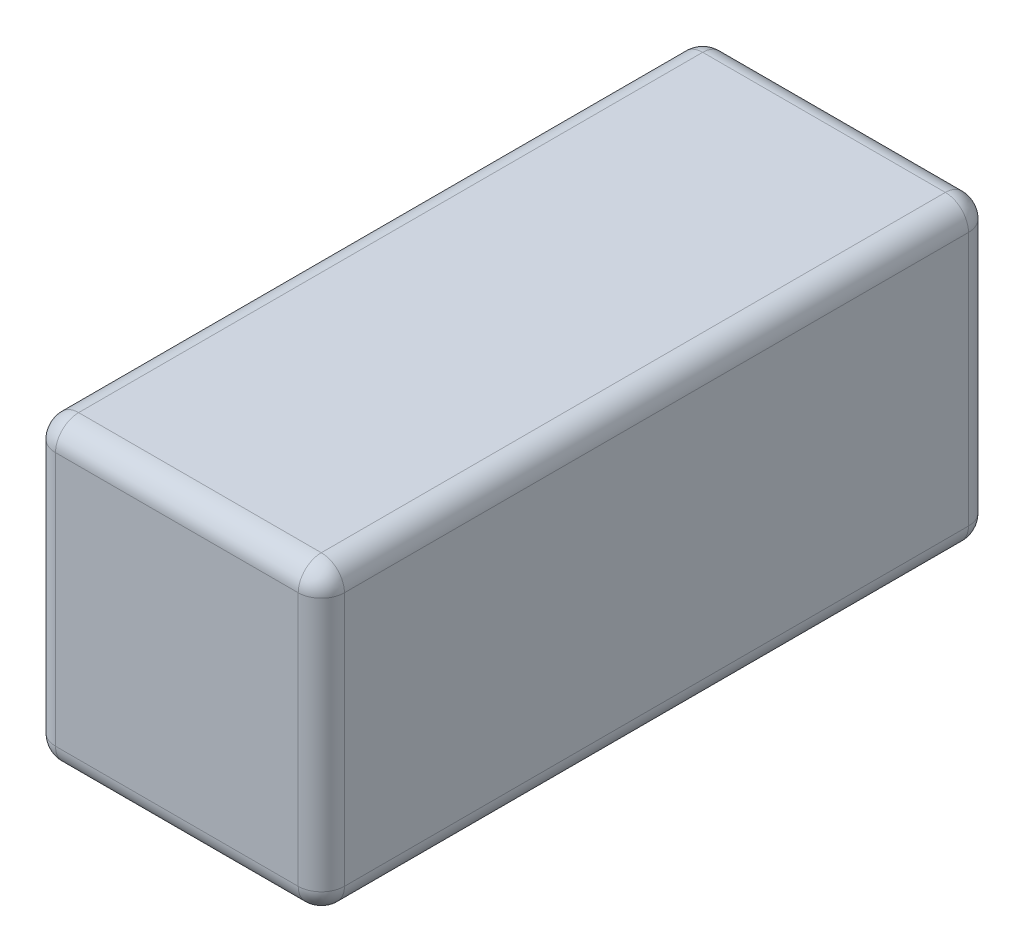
ISO-10303-21;
HEADER;
FILE_DESCRIPTION(('STEP AP214'),'2;1');
FILE_NAME('part.step','',(''),(''),'','','');
FILE_SCHEMA(('AUTOMOTIVE_DESIGN { 1 0 10303 214 1 1 1 1 }'));
ENDSEC;
DATA;
#1=APPLICATION_CONTEXT('core data for automotive mechanical design processes');
#2=APPLICATION_PROTOCOL_DEFINITION('international standard','automotive_design',2000,#1);
#3=PRODUCT_CONTEXT('',#1,'mechanical');
#4=PRODUCT('Part','Part','',(#3));
#5=PRODUCT_RELATED_PRODUCT_CATEGORY('part','',(#4));
#6=PRODUCT_DEFINITION_FORMATION('','',#4);
#7=PRODUCT_DEFINITION_CONTEXT('part definition',#1,'design');
#8=PRODUCT_DEFINITION('design','',#6,#7);
#9=PRODUCT_DEFINITION_SHAPE('','',#8);
#10=(LENGTH_UNIT() NAMED_UNIT(*) SI_UNIT(.MILLI.,.METRE.));
#11=(NAMED_UNIT(*) PLANE_ANGLE_UNIT() SI_UNIT($,.RADIAN.));
#12=(NAMED_UNIT(*) SI_UNIT($,.STERADIAN.) SOLID_ANGLE_UNIT());
#13=UNCERTAINTY_MEASURE_WITH_UNIT(LENGTH_MEASURE(1.E-05),#10,'distance_accuracy_value','');
#14=(GEOMETRIC_REPRESENTATION_CONTEXT(3) GLOBAL_UNCERTAINTY_ASSIGNED_CONTEXT((#13)) GLOBAL_UNIT_ASSIGNED_CONTEXT((#10,
#11,#12)) REPRESENTATION_CONTEXT('',''));
#15=CARTESIAN_POINT('',(0.,0.,0.));
#16=DIRECTION('',(0.,0.,1.));
#17=DIRECTION('',(1.,0.,0.));
#18=AXIS2_PLACEMENT_3D('',#15,#16,#17);
#19=CARTESIAN_POINT('',(-12.5,13.,29.));
#20=DIRECTION('',(1.,0.,0.));
#21=DIRECTION('',(0.,0.,-1.));
#22=AXIS2_PLACEMENT_3D('',#19,#20,#21);
#23=PLANE('',#22);
#24=DIRECTION('',(0.,0.,-1.));
#25=VECTOR('',#24,1.);
#26=CARTESIAN_POINT('',(-12.5,-11.,29.));
#27=LINE('',#26,#25);
#28=CARTESIAN_POINT('',(-12.5,-11.,-27.));
#29=VERTEX_POINT('',#28);
#30=CARTESIAN_POINT('',(-12.5,-11.,27.));
#31=VERTEX_POINT('',#30);
#32=EDGE_CURVE('E237',#29,#31,#27,.F.);
#33=ORIENTED_EDGE('',*,*,#32,.T.);
#34=DIRECTION('',(0.,-1.,0.));
#35=VECTOR('',#34,1.);
#36=CARTESIAN_POINT('',(-12.5,13.,27.));
#37=LINE('',#36,#35);
#38=CARTESIAN_POINT('',(-12.5,11.,27.));
#39=VERTEX_POINT('',#38);
#40=EDGE_CURVE('E239',#31,#39,#37,.F.);
#41=ORIENTED_EDGE('',*,*,#40,.T.);
#42=DIRECTION('',(0.,0.,-1.));
#43=VECTOR('',#42,1.);
#44=CARTESIAN_POINT('',(-12.5,11.,29.));
#45=LINE('',#44,#43);
#46=CARTESIAN_POINT('',(-12.5,11.,-27.));
#47=VERTEX_POINT('',#46);
#48=EDGE_CURVE('E228',#39,#47,#45,.T.);
#49=ORIENTED_EDGE('',*,*,#48,.T.);
#50=DIRECTION('',(0.,-1.,0.));
#51=VECTOR('',#50,1.);
#52=CARTESIAN_POINT('',(-12.5,13.,-27.));
#53=LINE('',#52,#51);
#54=EDGE_CURVE('E235',#47,#29,#53,.T.);
#55=ORIENTED_EDGE('',*,*,#54,.T.);
#56=EDGE_LOOP('',(#33,#41,#49,#55));
#57=FACE_BOUND('',#56,.T.);
#58=ADVANCED_FACE('F39',(#57),#23,.F.);
#59=CARTESIAN_POINT('',(-12.5,-13.,29.));
#60=DIRECTION('',(0.,1.,0.));
#61=DIRECTION('',(0.,0.,1.));
#62=AXIS2_PLACEMENT_3D('',#59,#60,#61);
#63=PLANE('',#62);
#64=DIRECTION('',(1.,0.,0.));
#65=VECTOR('',#64,1.);
#66=CARTESIAN_POINT('',(-12.5,-13.,-27.));
#67=LINE('',#66,#65);
#68=CARTESIAN_POINT('',(-10.5,-13.,-27.));
#69=VERTEX_POINT('',#68);
#70=CARTESIAN_POINT('',(10.5,-13.,-27.));
#71=VERTEX_POINT('',#70);
#72=EDGE_CURVE('E272',#69,#71,#67,.T.);
#73=ORIENTED_EDGE('',*,*,#72,.T.);
#74=DIRECTION('',(0.,0.,-1.));
#75=VECTOR('',#74,1.);
#76=CARTESIAN_POINT('',(10.5,-13.,29.));
#77=LINE('',#76,#75);
#78=CARTESIAN_POINT('',(10.5,-13.,27.));
#79=VERTEX_POINT('',#78);
#80=EDGE_CURVE('E290',#71,#79,#77,.F.);
#81=ORIENTED_EDGE('',*,*,#80,.T.);
#82=DIRECTION('',(1.,0.,0.));
#83=VECTOR('',#82,1.);
#84=CARTESIAN_POINT('',(-12.5,-13.,27.));
#85=LINE('',#84,#83);
#86=CARTESIAN_POINT('',(-10.5,-13.,27.));
#87=VERTEX_POINT('',#86);
#88=EDGE_CURVE('E220',#79,#87,#85,.F.);
#89=ORIENTED_EDGE('',*,*,#88,.T.);
#90=DIRECTION('',(0.,0.,-1.));
#91=VECTOR('',#90,1.);
#92=CARTESIAN_POINT('',(-10.5,-13.,29.));
#93=LINE('',#92,#91);
#94=EDGE_CURVE('E287',#87,#69,#93,.T.);
#95=ORIENTED_EDGE('',*,*,#94,.T.);
#96=EDGE_LOOP('',(#73,#81,#89,#95));
#97=FACE_BOUND('',#96,.T.);
#98=ADVANCED_FACE('F307',(#97),#63,.F.);
#99=CARTESIAN_POINT('',(12.5,13.,29.));
#100=DIRECTION('',(-1.,0.,0.));
#101=DIRECTION('',(0.,0.,1.));
#102=AXIS2_PLACEMENT_3D('',#99,#100,#101);
#103=PLANE('',#102);
#104=DIRECTION('',(0.,0.,-1.));
#105=VECTOR('',#104,1.);
#106=CARTESIAN_POINT('',(12.5,11.,29.));
#107=LINE('',#106,#105);
#108=CARTESIAN_POINT('',(12.5,11.,-27.));
#109=VERTEX_POINT('',#108);
#110=CARTESIAN_POINT('',(12.5,11.,27.));
#111=VERTEX_POINT('',#110);
#112=EDGE_CURVE('E273',#109,#111,#107,.F.);
#113=ORIENTED_EDGE('',*,*,#112,.T.);
#114=DIRECTION('',(0.,1.,0.));
#115=VECTOR('',#114,1.);
#116=CARTESIAN_POINT('',(12.5,-13.,27.));
#117=LINE('',#116,#115);
#118=CARTESIAN_POINT('',(12.5,-11.,27.));
#119=VERTEX_POINT('',#118);
#120=EDGE_CURVE('E266',#111,#119,#117,.F.);
#121=ORIENTED_EDGE('',*,*,#120,.T.);
#122=DIRECTION('',(0.,0.,-1.));
#123=VECTOR('',#122,1.);
#124=CARTESIAN_POINT('',(12.5,-11.,29.));
#125=LINE('',#124,#123);
#126=CARTESIAN_POINT('',(12.5,-11.,-27.));
#127=VERTEX_POINT('',#126);
#128=EDGE_CURVE('E281',#119,#127,#125,.T.);
#129=ORIENTED_EDGE('',*,*,#128,.T.);
#130=DIRECTION('',(0.,1.,0.));
#131=VECTOR('',#130,1.);
#132=CARTESIAN_POINT('',(12.5,13.,-27.));
#133=LINE('',#132,#131);
#134=EDGE_CURVE('E277',#127,#109,#133,.T.);
#135=ORIENTED_EDGE('',*,*,#134,.T.);
#136=EDGE_LOOP('',(#113,#121,#129,#135));
#137=FACE_BOUND('',#136,.T.);
#138=ADVANCED_FACE('F276',(#137),#103,.F.);
#139=CARTESIAN_POINT('',(-12.5,13.,29.));
#140=DIRECTION('',(0.,-1.,0.));
#141=DIRECTION('',(0.,0.,-1.));
#142=AXIS2_PLACEMENT_3D('',#139,#140,#141);
#143=PLANE('',#142);
#144=DIRECTION('',(-1.,0.,0.));
#145=VECTOR('',#144,1.);
#146=CARTESIAN_POINT('',(12.5,13.,27.));
#147=LINE('',#146,#145);
#148=CARTESIAN_POINT('',(-10.5,13.,27.));
#149=VERTEX_POINT('',#148);
#150=CARTESIAN_POINT('',(10.5,13.,27.));
#151=VERTEX_POINT('',#150);
#152=EDGE_CURVE('E141',#149,#151,#147,.F.);
#153=ORIENTED_EDGE('',*,*,#152,.T.);
#154=DIRECTION('',(0.,0.,-1.));
#155=VECTOR('',#154,1.);
#156=CARTESIAN_POINT('',(10.5,13.,29.));
#157=LINE('',#156,#155);
#158=CARTESIAN_POINT('',(10.5,13.,-27.));
#159=VERTEX_POINT('',#158);
#160=EDGE_CURVE('E137',#151,#159,#157,.T.);
#161=ORIENTED_EDGE('',*,*,#160,.T.);
#162=DIRECTION('',(-1.,0.,0.));
#163=VECTOR('',#162,1.);
#164=CARTESIAN_POINT('',(-12.5,13.,-27.));
#165=LINE('',#164,#163);
#166=CARTESIAN_POINT('',(-10.5,13.,-27.));
#167=VERTEX_POINT('',#166);
#168=EDGE_CURVE('E131',#159,#167,#165,.T.);
#169=ORIENTED_EDGE('',*,*,#168,.T.);
#170=DIRECTION('',(0.,0.,-1.));
#171=VECTOR('',#170,1.);
#172=CARTESIAN_POINT('',(-10.5,13.,29.));
#173=LINE('',#172,#171);
#174=EDGE_CURVE('E134',#167,#149,#173,.F.);
#175=ORIENTED_EDGE('',*,*,#174,.T.);
#176=EDGE_LOOP('',(#153,#161,#169,#175));
#177=FACE_BOUND('',#176,.T.);
#178=ADVANCED_FACE('F133',(#177),#143,.F.);
#179=CARTESIAN_POINT('',(0.,0.,29.));
#180=DIRECTION('',(0.,0.,1.));
#181=DIRECTION('',(1.,0.,0.));
#182=AXIS2_PLACEMENT_3D('',#179,#180,#181);
#183=PLANE('',#182);
#184=DIRECTION('',(1.,0.,0.));
#185=VECTOR('',#184,1.);
#186=CARTESIAN_POINT('',(12.5,-11.,29.));
#187=LINE('',#186,#185);
#188=CARTESIAN_POINT('',(-10.5,-11.,29.));
#189=VERTEX_POINT('',#188);
#190=CARTESIAN_POINT('',(10.5,-11.,29.));
#191=VERTEX_POINT('',#190);
#192=EDGE_CURVE('E223',#189,#191,#187,.T.);
#193=ORIENTED_EDGE('',*,*,#192,.T.);
#194=DIRECTION('',(0.,1.,0.));
#195=VECTOR('',#194,1.);
#196=CARTESIAN_POINT('',(10.5,13.,29.));
#197=LINE('',#196,#195);
#198=CARTESIAN_POINT('',(10.5,11.,29.));
#199=VERTEX_POINT('',#198);
#200=EDGE_CURVE('E225',#191,#199,#197,.T.);
#201=ORIENTED_EDGE('',*,*,#200,.T.);
#202=DIRECTION('',(-1.,0.,0.));
#203=VECTOR('',#202,1.);
#204=CARTESIAN_POINT('',(-12.5,11.,29.));
#205=LINE('',#204,#203);
#206=CARTESIAN_POINT('',(-10.5,11.,29.));
#207=VERTEX_POINT('',#206);
#208=EDGE_CURVE('E226',#199,#207,#205,.T.);
#209=ORIENTED_EDGE('',*,*,#208,.T.);
#210=DIRECTION('',(0.,-1.,0.));
#211=VECTOR('',#210,1.);
#212=CARTESIAN_POINT('',(-10.5,-13.,29.));
#213=LINE('',#212,#211);
#214=EDGE_CURVE('E230',#207,#189,#213,.T.);
#215=ORIENTED_EDGE('',*,*,#214,.T.);
#216=EDGE_LOOP('',(#193,#201,#209,#215));
#217=FACE_BOUND('',#216,.T.);
#218=ADVANCED_FACE('F292',(#217),#183,.T.);
#219=CARTESIAN_POINT('',(0.,0.,-29.));
#220=DIRECTION('',(0.,0.,1.));
#221=DIRECTION('',(1.,0.,0.));
#222=AXIS2_PLACEMENT_3D('',#219,#220,#221);
#223=PLANE('',#222);
#224=DIRECTION('',(-1.,0.,0.));
#225=VECTOR('',#224,1.);
#226=CARTESIAN_POINT('',(0.,11.,-29.));
#227=LINE('',#226,#225);
#228=CARTESIAN_POINT('',(-10.5,11.,-29.));
#229=VERTEX_POINT('',#228);
#230=CARTESIAN_POINT('',(10.5,11.,-29.));
#231=VERTEX_POINT('',#230);
#232=EDGE_CURVE('E162',#229,#231,#227,.F.);
#233=ORIENTED_EDGE('',*,*,#232,.T.);
#234=DIRECTION('',(0.,1.,0.));
#235=VECTOR('',#234,1.);
#236=CARTESIAN_POINT('',(10.5,0.,-29.));
#237=LINE('',#236,#235);
#238=CARTESIAN_POINT('',(10.5,-11.,-29.));
#239=VERTEX_POINT('',#238);
#240=EDGE_CURVE('E11',#231,#239,#237,.F.);
#241=ORIENTED_EDGE('',*,*,#240,.T.);
#242=DIRECTION('',(1.,0.,0.));
#243=VECTOR('',#242,1.);
#244=CARTESIAN_POINT('',(0.,-11.,-29.));
#245=LINE('',#244,#243);
#246=CARTESIAN_POINT('',(-10.5,-11.,-29.));
#247=VERTEX_POINT('',#246);
#248=EDGE_CURVE('E48',#239,#247,#245,.F.);
#249=ORIENTED_EDGE('',*,*,#248,.T.);
#250=DIRECTION('',(0.,-1.,0.));
#251=VECTOR('',#250,1.);
#252=CARTESIAN_POINT('',(-10.5,0.,-29.));
#253=LINE('',#252,#251);
#254=EDGE_CURVE('E243',#247,#229,#253,.F.);
#255=ORIENTED_EDGE('',*,*,#254,.T.);
#256=EDGE_LOOP('',(#233,#241,#249,#255));
#257=FACE_BOUND('',#256,.T.);
#258=ADVANCED_FACE('F481',(#257),#223,.F.);
#259=CARTESIAN_POINT('',(-10.5,-11.,29.));
#260=DIRECTION('',(0.,0.,-1.));
#261=DIRECTION('',(-1.,0.,0.));
#262=AXIS2_PLACEMENT_3D('',#259,#260,#261);
#263=CYLINDRICAL_SURFACE('',#262,2.);
#264=CARTESIAN_POINT('',(-10.5,-11.,27.));
#265=DIRECTION('',(0.,0.,1.));
#266=DIRECTION('',(1.,0.,0.));
#267=AXIS2_PLACEMENT_3D('',#264,#265,#266);
#268=CIRCLE('',#267,2.);
#269=EDGE_CURVE('E43',#31,#87,#268,.T.);
#270=ORIENTED_EDGE('',*,*,#269,.F.);
#271=ORIENTED_EDGE('',*,*,#32,.F.);
#272=CARTESIAN_POINT('',(-10.5,-11.,-27.));
#273=DIRECTION('',(0.,0.,-1.));
#274=DIRECTION('',(-1.,0.,0.));
#275=AXIS2_PLACEMENT_3D('',#272,#273,#274);
#276=CIRCLE('',#275,2.);
#277=EDGE_CURVE('E199',#69,#29,#276,.T.);
#278=ORIENTED_EDGE('',*,*,#277,.F.);
#279=ORIENTED_EDGE('',*,*,#94,.F.);
#280=EDGE_LOOP('',(#270,#271,#278,#279));
#281=FACE_BOUND('',#280,.T.);
#282=ADVANCED_FACE('F41',(#281),#263,.T.);
#283=CARTESIAN_POINT('',(-10.5,-11.,27.));
#284=DIRECTION('',(0.,-1.,0.));
#285=DIRECTION('',(0.,0.,-1.));
#286=AXIS2_PLACEMENT_3D('',#283,#284,#285);
#287=SPHERICAL_SURFACE('',#286,2.);
#288=CARTESIAN_POINT('',(-10.5,-11.,27.));
#289=DIRECTION('',(0.,-1.,0.));
#290=DIRECTION('',(0.,0.,-1.));
#291=AXIS2_PLACEMENT_3D('',#288,#289,#290);
#292=CIRCLE('',#291,2.);
#293=EDGE_CURVE('E194',#31,#189,#292,.F.);
#294=ORIENTED_EDGE('',*,*,#293,.F.);
#295=ORIENTED_EDGE('',*,*,#269,.T.);
#296=CARTESIAN_POINT('',(-10.5,-11.,27.));
#297=DIRECTION('',(-1.,0.,0.));
#298=DIRECTION('',(0.,0.,1.));
#299=AXIS2_PLACEMENT_3D('',#296,#297,#298);
#300=CIRCLE('',#299,2.);
#301=EDGE_CURVE('E197',#189,#87,#300,.F.);
#302=ORIENTED_EDGE('',*,*,#301,.F.);
#303=EDGE_LOOP('',(#294,#295,#302));
#304=FACE_BOUND('',#303,.T.);
#305=ADVANCED_FACE('F210',(#304),#287,.T.);
#306=CARTESIAN_POINT('',(-10.5,-11.,-27.));
#307=DIRECTION('',(-1.,0.,0.));
#308=DIRECTION('',(0.,0.,1.));
#309=AXIS2_PLACEMENT_3D('',#306,#307,#308);
#310=SPHERICAL_SURFACE('',#309,2.);
#311=CARTESIAN_POINT('',(-10.5,-11.,-27.));
#312=DIRECTION('',(-1.,0.,0.));
#313=DIRECTION('',(0.,0.,1.));
#314=AXIS2_PLACEMENT_3D('',#311,#312,#313);
#315=CIRCLE('',#314,2.);
#316=EDGE_CURVE('E189',#69,#247,#315,.F.);
#317=ORIENTED_EDGE('',*,*,#316,.F.);
#318=ORIENTED_EDGE('',*,*,#277,.T.);
#319=CARTESIAN_POINT('',(-10.5,-11.,-27.));
#320=DIRECTION('',(0.,-1.,0.));
#321=DIRECTION('',(0.,0.,-1.));
#322=AXIS2_PLACEMENT_3D('',#319,#320,#321);
#323=CIRCLE('',#322,2.);
#324=EDGE_CURVE('E191',#247,#29,#323,.F.);
#325=ORIENTED_EDGE('',*,*,#324,.F.);
#326=EDGE_LOOP('',(#317,#318,#325));
#327=FACE_BOUND('',#326,.T.);
#328=ADVANCED_FACE('F300',(#327),#310,.T.);
#329=CARTESIAN_POINT('',(0.,-11.,27.));
#330=DIRECTION('',(-1.,0.,0.));
#331=DIRECTION('',(0.,0.,1.));
#332=AXIS2_PLACEMENT_3D('',#329,#330,#331);
#333=CYLINDRICAL_SURFACE('',#332,2.);
#334=ORIENTED_EDGE('',*,*,#301,.T.);
#335=ORIENTED_EDGE('',*,*,#88,.F.);
#336=CARTESIAN_POINT('',(10.5,-11.,27.));
#337=DIRECTION('',(1.,0.,0.));
#338=DIRECTION('',(0.,0.,-1.));
#339=AXIS2_PLACEMENT_3D('',#336,#337,#338);
#340=CIRCLE('',#339,2.);
#341=EDGE_CURVE('E184',#191,#79,#340,.T.);
#342=ORIENTED_EDGE('',*,*,#341,.F.);
#343=ORIENTED_EDGE('',*,*,#192,.F.);
#344=EDGE_LOOP('',(#334,#335,#342,#343));
#345=FACE_BOUND('',#344,.T.);
#346=ADVANCED_FACE('F218',(#345),#333,.T.);
#347=CARTESIAN_POINT('',(-10.5,0.,27.));
#348=DIRECTION('',(0.,1.,0.));
#349=DIRECTION('',(0.,0.,1.));
#350=AXIS2_PLACEMENT_3D('',#347,#348,#349);
#351=CYLINDRICAL_SURFACE('',#350,2.);
#352=ORIENTED_EDGE('',*,*,#293,.T.);
#353=ORIENTED_EDGE('',*,*,#214,.F.);
#354=CARTESIAN_POINT('',(-10.5,11.,27.));
#355=DIRECTION('',(0.,1.,0.));
#356=DIRECTION('',(0.,0.,1.));
#357=AXIS2_PLACEMENT_3D('',#354,#355,#356);
#358=CIRCLE('',#357,2.);
#359=EDGE_CURVE('E181',#39,#207,#358,.T.);
#360=ORIENTED_EDGE('',*,*,#359,.F.);
#361=ORIENTED_EDGE('',*,*,#40,.F.);
#362=EDGE_LOOP('',(#352,#353,#360,#361));
#363=FACE_BOUND('',#362,.T.);
#364=ADVANCED_FACE('F296',(#363),#351,.T.);
#365=CARTESIAN_POINT('',(-10.5,11.,29.));
#366=DIRECTION('',(0.,0.,-1.));
#367=DIRECTION('',(-1.,0.,0.));
#368=AXIS2_PLACEMENT_3D('',#365,#366,#367);
#369=CYLINDRICAL_SURFACE('',#368,2.);
#370=CARTESIAN_POINT('',(-10.5,11.,-27.));
#371=DIRECTION('',(0.,0.,-1.));
#372=DIRECTION('',(-1.,0.,0.));
#373=AXIS2_PLACEMENT_3D('',#370,#371,#372);
#374=CIRCLE('',#373,2.);
#375=EDGE_CURVE('E148',#47,#167,#374,.T.);
#376=ORIENTED_EDGE('',*,*,#375,.F.);
#377=ORIENTED_EDGE('',*,*,#48,.F.);
#378=CARTESIAN_POINT('',(-10.5,11.,27.));
#379=DIRECTION('',(0.,0.,1.));
#380=DIRECTION('',(1.,0.,0.));
#381=AXIS2_PLACEMENT_3D('',#378,#379,#380);
#382=CIRCLE('',#381,2.);
#383=EDGE_CURVE('E150',#149,#39,#382,.T.);
#384=ORIENTED_EDGE('',*,*,#383,.F.);
#385=ORIENTED_EDGE('',*,*,#174,.F.);
#386=EDGE_LOOP('',(#376,#377,#384,#385));
#387=FACE_BOUND('',#386,.T.);
#388=ADVANCED_FACE('F146',(#387),#369,.T.);
#389=CARTESIAN_POINT('',(-10.5,13.,-27.));
#390=DIRECTION('',(0.,-1.,0.));
#391=DIRECTION('',(0.,0.,-1.));
#392=AXIS2_PLACEMENT_3D('',#389,#390,#391);
#393=CYLINDRICAL_SURFACE('',#392,2.);
#394=ORIENTED_EDGE('',*,*,#324,.T.);
#395=ORIENTED_EDGE('',*,*,#54,.F.);
#396=CARTESIAN_POINT('',(-10.5,11.,-27.));
#397=DIRECTION('',(0.,1.,0.));
#398=DIRECTION('',(0.,0.,1.));
#399=AXIS2_PLACEMENT_3D('',#396,#397,#398);
#400=CIRCLE('',#399,2.);
#401=EDGE_CURVE('E159',#229,#47,#400,.T.);
#402=ORIENTED_EDGE('',*,*,#401,.F.);
#403=ORIENTED_EDGE('',*,*,#254,.F.);
#404=EDGE_LOOP('',(#394,#395,#402,#403));
#405=FACE_BOUND('',#404,.T.);
#406=ADVANCED_FACE('F431',(#405),#393,.T.);
#407=CARTESIAN_POINT('',(-12.5,-11.,-27.));
#408=DIRECTION('',(1.,0.,0.));
#409=DIRECTION('',(0.,0.,-1.));
#410=AXIS2_PLACEMENT_3D('',#407,#408,#409);
#411=CYLINDRICAL_SURFACE('',#410,2.);
#412=ORIENTED_EDGE('',*,*,#316,.T.);
#413=ORIENTED_EDGE('',*,*,#248,.F.);
#414=CARTESIAN_POINT('',(10.5,-11.,-27.));
#415=DIRECTION('',(1.,0.,0.));
#416=DIRECTION('',(0.,0.,-1.));
#417=AXIS2_PLACEMENT_3D('',#414,#415,#416);
#418=CIRCLE('',#417,2.);
#419=EDGE_CURVE('E177',#71,#239,#418,.T.);
#420=ORIENTED_EDGE('',*,*,#419,.F.);
#421=ORIENTED_EDGE('',*,*,#72,.F.);
#422=EDGE_LOOP('',(#412,#413,#420,#421));
#423=FACE_BOUND('',#422,.T.);
#424=ADVANCED_FACE('F304',(#423),#411,.T.);
#425=CARTESIAN_POINT('',(10.5,-11.,29.));
#426=DIRECTION('',(0.,0.,-1.));
#427=DIRECTION('',(-1.,0.,0.));
#428=AXIS2_PLACEMENT_3D('',#425,#426,#427);
#429=CYLINDRICAL_SURFACE('',#428,2.);
#430=CARTESIAN_POINT('',(10.5,-11.,27.));
#431=DIRECTION('',(0.,0.,1.));
#432=DIRECTION('',(1.,0.,0.));
#433=AXIS2_PLACEMENT_3D('',#430,#431,#432);
#434=CIRCLE('',#433,2.);
#435=EDGE_CURVE('E186',#79,#119,#434,.T.);
#436=ORIENTED_EDGE('',*,*,#435,.F.);
#437=ORIENTED_EDGE('',*,*,#80,.F.);
#438=CARTESIAN_POINT('',(10.5,-11.,-27.));
#439=DIRECTION('',(0.,0.,-1.));
#440=DIRECTION('',(-1.,0.,0.));
#441=AXIS2_PLACEMENT_3D('',#438,#439,#440);
#442=CIRCLE('',#441,2.);
#443=EDGE_CURVE('E174',#127,#71,#442,.T.);
#444=ORIENTED_EDGE('',*,*,#443,.F.);
#445=ORIENTED_EDGE('',*,*,#128,.F.);
#446=EDGE_LOOP('',(#436,#437,#444,#445));
#447=FACE_BOUND('',#446,.T.);
#448=ADVANCED_FACE('F311',(#447),#429,.T.);
#449=CARTESIAN_POINT('',(10.5,-11.,27.));
#450=DIRECTION('',(0.,-1.,0.));
#451=DIRECTION('',(0.,0.,-1.));
#452=AXIS2_PLACEMENT_3D('',#449,#450,#451);
#453=SPHERICAL_SURFACE('',#452,2.);
#454=ORIENTED_EDGE('',*,*,#341,.T.);
#455=ORIENTED_EDGE('',*,*,#435,.T.);
#456=CARTESIAN_POINT('',(10.5,-11.,27.));
#457=DIRECTION('',(0.,-1.,0.));
#458=DIRECTION('',(0.,0.,-1.));
#459=AXIS2_PLACEMENT_3D('',#456,#457,#458);
#460=CIRCLE('',#459,2.);
#461=EDGE_CURVE('E166',#191,#119,#460,.F.);
#462=ORIENTED_EDGE('',*,*,#461,.F.);
#463=EDGE_LOOP('',(#454,#455,#462));
#464=FACE_BOUND('',#463,.T.);
#465=ADVANCED_FACE('F313',(#464),#453,.T.);
#466=CARTESIAN_POINT('',(-10.5,11.,27.));
#467=DIRECTION('',(-1.,0.,0.));
#468=DIRECTION('',(0.,0.,1.));
#469=AXIS2_PLACEMENT_3D('',#466,#467,#468);
#470=SPHERICAL_SURFACE('',#469,2.);
#471=ORIENTED_EDGE('',*,*,#383,.T.);
#472=ORIENTED_EDGE('',*,*,#359,.T.);
#473=CARTESIAN_POINT('',(-10.5,11.,27.));
#474=DIRECTION('',(-1.,0.,0.));
#475=DIRECTION('',(0.,0.,1.));
#476=AXIS2_PLACEMENT_3D('',#473,#474,#475);
#477=CIRCLE('',#476,2.);
#478=EDGE_CURVE('E163',#149,#207,#477,.F.);
#479=ORIENTED_EDGE('',*,*,#478,.F.);
#480=EDGE_LOOP('',(#471,#472,#479));
#481=FACE_BOUND('',#480,.T.);
#482=ADVANCED_FACE('F315',(#481),#470,.T.);
#483=CARTESIAN_POINT('',(-10.5,11.,-27.));
#484=DIRECTION('',(-1.,0.,0.));
#485=DIRECTION('',(0.,0.,1.));
#486=AXIS2_PLACEMENT_3D('',#483,#484,#485);
#487=SPHERICAL_SURFACE('',#486,2.);
#488=ORIENTED_EDGE('',*,*,#401,.T.);
#489=ORIENTED_EDGE('',*,*,#375,.T.);
#490=CARTESIAN_POINT('',(-10.5,11.,-27.));
#491=DIRECTION('',(-1.,0.,0.));
#492=DIRECTION('',(0.,0.,1.));
#493=AXIS2_PLACEMENT_3D('',#490,#491,#492);
#494=CIRCLE('',#493,2.);
#495=EDGE_CURVE('E156',#229,#167,#494,.F.);
#496=ORIENTED_EDGE('',*,*,#495,.F.);
#497=EDGE_LOOP('',(#488,#489,#496));
#498=FACE_BOUND('',#497,.T.);
#499=ADVANCED_FACE('F155',(#498),#487,.T.);
#500=CARTESIAN_POINT('',(10.5,-11.,-27.));
#501=DIRECTION('',(0.,-1.,0.));
#502=DIRECTION('',(0.,0.,-1.));
#503=AXIS2_PLACEMENT_3D('',#500,#501,#502);
#504=SPHERICAL_SURFACE('',#503,2.);
#505=ORIENTED_EDGE('',*,*,#443,.T.);
#506=ORIENTED_EDGE('',*,*,#419,.T.);
#507=CARTESIAN_POINT('',(10.5,-11.,-27.));
#508=DIRECTION('',(0.,-1.,0.));
#509=DIRECTION('',(1.,0.,0.));
#510=AXIS2_PLACEMENT_3D('',#507,#508,#509);
#511=CIRCLE('',#510,2.);
#512=EDGE_CURVE('E56',#127,#239,#511,.F.);
#513=ORIENTED_EDGE('',*,*,#512,.F.);
#514=EDGE_LOOP('',(#505,#506,#513));
#515=FACE_BOUND('',#514,.T.);
#516=ADVANCED_FACE('F352',(#515),#504,.T.);
#517=CARTESIAN_POINT('',(10.5,0.,27.));
#518=DIRECTION('',(0.,-1.,0.));
#519=DIRECTION('',(0.,0.,-1.));
#520=AXIS2_PLACEMENT_3D('',#517,#518,#519);
#521=CYLINDRICAL_SURFACE('',#520,2.);
#522=ORIENTED_EDGE('',*,*,#461,.T.);
#523=ORIENTED_EDGE('',*,*,#120,.F.);
#524=CARTESIAN_POINT('',(10.5,11.,27.));
#525=DIRECTION('',(0.,1.,0.));
#526=DIRECTION('',(0.,0.,1.));
#527=AXIS2_PLACEMENT_3D('',#524,#525,#526);
#528=CIRCLE('',#527,2.);
#529=EDGE_CURVE('E168',#199,#111,#528,.T.);
#530=ORIENTED_EDGE('',*,*,#529,.F.);
#531=ORIENTED_EDGE('',*,*,#200,.F.);
#532=EDGE_LOOP('',(#522,#523,#530,#531));
#533=FACE_BOUND('',#532,.T.);
#534=ADVANCED_FACE('F268',(#533),#521,.T.);
#535=CARTESIAN_POINT('',(0.,11.,27.));
#536=DIRECTION('',(1.,0.,0.));
#537=DIRECTION('',(0.,0.,-1.));
#538=AXIS2_PLACEMENT_3D('',#535,#536,#537);
#539=CYLINDRICAL_SURFACE('',#538,2.);
#540=ORIENTED_EDGE('',*,*,#478,.T.);
#541=ORIENTED_EDGE('',*,*,#208,.F.);
#542=CARTESIAN_POINT('',(10.5,11.,27.));
#543=DIRECTION('',(1.,0.,0.));
#544=DIRECTION('',(0.,0.,-1.));
#545=AXIS2_PLACEMENT_3D('',#542,#543,#544);
#546=CIRCLE('',#545,2.);
#547=EDGE_CURVE('E256',#151,#199,#546,.T.);
#548=ORIENTED_EDGE('',*,*,#547,.F.);
#549=ORIENTED_EDGE('',*,*,#152,.F.);
#550=EDGE_LOOP('',(#540,#541,#548,#549));
#551=FACE_BOUND('',#550,.T.);
#552=ADVANCED_FACE('F346',(#551),#539,.T.);
#553=CARTESIAN_POINT('',(-12.5,11.,-27.));
#554=DIRECTION('',(-1.,0.,0.));
#555=DIRECTION('',(0.,0.,1.));
#556=AXIS2_PLACEMENT_3D('',#553,#554,#555);
#557=CYLINDRICAL_SURFACE('',#556,2.);
#558=ORIENTED_EDGE('',*,*,#495,.T.);
#559=ORIENTED_EDGE('',*,*,#168,.F.);
#560=CARTESIAN_POINT('',(10.5,11.,-27.));
#561=DIRECTION('',(1.,0.,0.));
#562=DIRECTION('',(0.,1.,0.));
#563=AXIS2_PLACEMENT_3D('',#560,#561,#562);
#564=CIRCLE('',#563,2.);
#565=EDGE_CURVE('E253',#231,#159,#564,.T.);
#566=ORIENTED_EDGE('',*,*,#565,.F.);
#567=ORIENTED_EDGE('',*,*,#232,.F.);
#568=EDGE_LOOP('',(#558,#559,#566,#567));
#569=FACE_BOUND('',#568,.T.);
#570=ADVANCED_FACE('F161',(#569),#557,.T.);
#571=CARTESIAN_POINT('',(10.5,13.,-27.));
#572=DIRECTION('',(0.,1.,0.));
#573=DIRECTION('',(0.,0.,1.));
#574=AXIS2_PLACEMENT_3D('',#571,#572,#573);
#575=CYLINDRICAL_SURFACE('',#574,2.);
#576=ORIENTED_EDGE('',*,*,#512,.T.);
#577=ORIENTED_EDGE('',*,*,#240,.F.);
#578=CARTESIAN_POINT('',(10.5,11.,-27.));
#579=DIRECTION('',(0.,1.,0.));
#580=DIRECTION('',(0.,0.,1.));
#581=AXIS2_PLACEMENT_3D('',#578,#579,#580);
#582=CIRCLE('',#581,2.);
#583=EDGE_CURVE('E250',#109,#231,#582,.T.);
#584=ORIENTED_EDGE('',*,*,#583,.F.);
#585=ORIENTED_EDGE('',*,*,#134,.F.);
#586=EDGE_LOOP('',(#576,#577,#584,#585));
#587=FACE_BOUND('',#586,.T.);
#588=ADVANCED_FACE('F341',(#587),#575,.T.);
#589=CARTESIAN_POINT('',(10.5,11.,27.));
#590=DIRECTION('',(0.,0.,1.));
#591=DIRECTION('',(1.,0.,0.));
#592=AXIS2_PLACEMENT_3D('',#589,#590,#591);
#593=SPHERICAL_SURFACE('',#592,2.);
#594=ORIENTED_EDGE('',*,*,#547,.T.);
#595=ORIENTED_EDGE('',*,*,#529,.T.);
#596=CARTESIAN_POINT('',(10.5,11.,27.));
#597=DIRECTION('',(0.,0.,1.));
#598=DIRECTION('',(1.,0.,0.));
#599=AXIS2_PLACEMENT_3D('',#596,#597,#598);
#600=CIRCLE('',#599,2.);
#601=EDGE_CURVE('E248',#151,#111,#600,.F.);
#602=ORIENTED_EDGE('',*,*,#601,.F.);
#603=EDGE_LOOP('',(#594,#595,#602));
#604=FACE_BOUND('',#603,.T.);
#605=ADVANCED_FACE('F263',(#604),#593,.T.);
#606=CARTESIAN_POINT('',(10.5,11.,-27.));
#607=DIRECTION('',(0.,0.,-1.));
#608=DIRECTION('',(-1.,0.,0.));
#609=AXIS2_PLACEMENT_3D('',#606,#607,#608);
#610=SPHERICAL_SURFACE('',#609,2.);
#611=ORIENTED_EDGE('',*,*,#583,.T.);
#612=ORIENTED_EDGE('',*,*,#565,.T.);
#613=CARTESIAN_POINT('',(10.5,11.,-27.));
#614=DIRECTION('',(0.,0.,-1.));
#615=DIRECTION('',(-1.,0.,0.));
#616=AXIS2_PLACEMENT_3D('',#613,#614,#615);
#617=CIRCLE('',#616,2.);
#618=EDGE_CURVE('E246',#109,#159,#617,.F.);
#619=ORIENTED_EDGE('',*,*,#618,.F.);
#620=EDGE_LOOP('',(#611,#612,#619));
#621=FACE_BOUND('',#620,.T.);
#622=ADVANCED_FACE('F335',(#621),#610,.T.);
#623=CARTESIAN_POINT('',(10.5,11.,29.));
#624=DIRECTION('',(0.,0.,-1.));
#625=DIRECTION('',(-1.,0.,0.));
#626=AXIS2_PLACEMENT_3D('',#623,#624,#625);
#627=CYLINDRICAL_SURFACE('',#626,2.);
#628=ORIENTED_EDGE('',*,*,#601,.T.);
#629=ORIENTED_EDGE('',*,*,#112,.F.);
#630=ORIENTED_EDGE('',*,*,#618,.T.);
#631=ORIENTED_EDGE('',*,*,#160,.F.);
#632=EDGE_LOOP('',(#628,#629,#630,#631));
#633=FACE_BOUND('',#632,.T.);
#634=ADVANCED_FACE('F332',(#633),#627,.T.);
#635=CLOSED_SHELL('',(#58,#98,#138,#178,#218,#258,#282,#305,#328,#346,#364,#388,#406,#424,#448,
#465,#482,#499,#516,#534,#552,#570,#588,#605,#622,#634));
#636=MANIFOLD_SOLID_BREP('B2',#635);
#637=ADVANCED_BREP_SHAPE_REPRESENTATION('',(#18,#636),#14);
#638=SHAPE_DEFINITION_REPRESENTATION(#9,#637);
ENDSEC;
END-ISO-10303-21;
